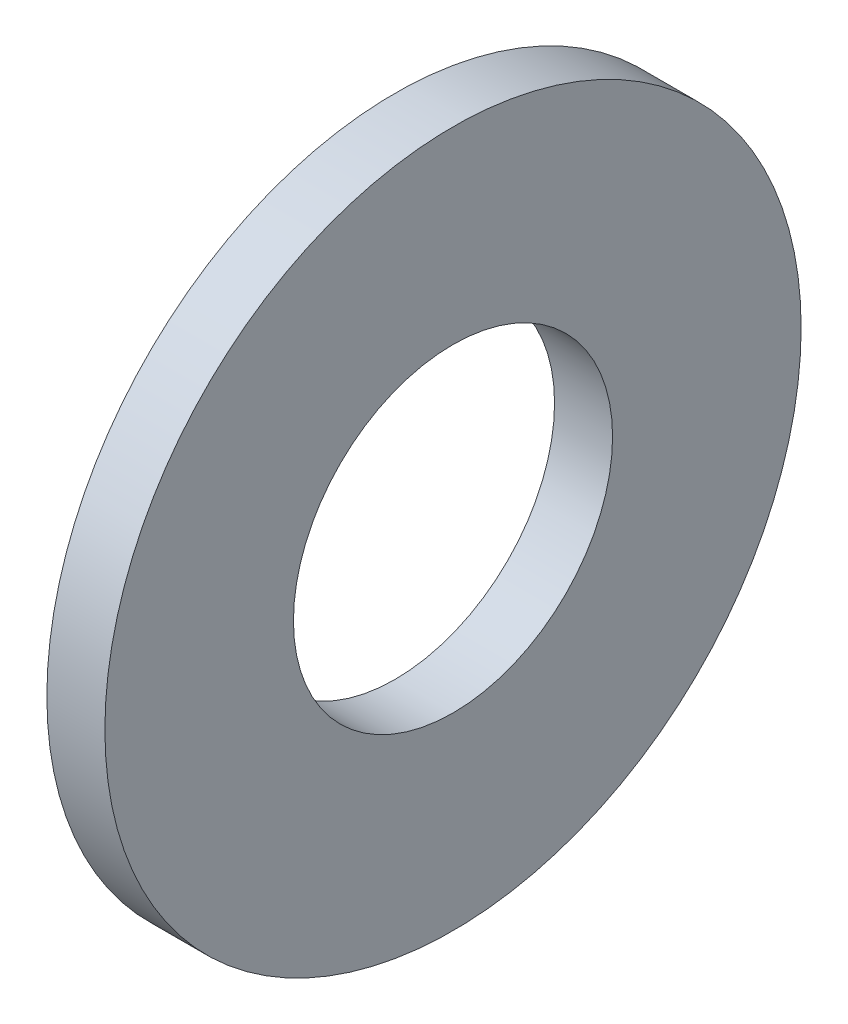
ISO-10303-21;
HEADER;
FILE_DESCRIPTION(('STEP AP214'),'2;1');
FILE_NAME('part.step','',(''),(''),'','','');
FILE_SCHEMA(('AUTOMOTIVE_DESIGN { 1 0 10303 214 1 1 1 1 }'));
ENDSEC;
DATA;
#1=APPLICATION_CONTEXT('core data for automotive mechanical design processes');
#2=APPLICATION_PROTOCOL_DEFINITION('international standard','automotive_design',2000,#1);
#3=PRODUCT_CONTEXT('',#1,'mechanical');
#4=PRODUCT('Part','Part','',(#3));
#5=PRODUCT_RELATED_PRODUCT_CATEGORY('part','',(#4));
#6=PRODUCT_DEFINITION_FORMATION('','',#4);
#7=PRODUCT_DEFINITION_CONTEXT('part definition',#1,'design');
#8=PRODUCT_DEFINITION('design','',#6,#7);
#9=PRODUCT_DEFINITION_SHAPE('','',#8);
#10=(LENGTH_UNIT() NAMED_UNIT(*) SI_UNIT(.MILLI.,.METRE.));
#11=(NAMED_UNIT(*) PLANE_ANGLE_UNIT() SI_UNIT($,.RADIAN.));
#12=(NAMED_UNIT(*) SI_UNIT($,.STERADIAN.) SOLID_ANGLE_UNIT());
#13=UNCERTAINTY_MEASURE_WITH_UNIT(LENGTH_MEASURE(1.E-05),#10,'distance_accuracy_value','');
#14=(GEOMETRIC_REPRESENTATION_CONTEXT(3) GLOBAL_UNCERTAINTY_ASSIGNED_CONTEXT((#13)) GLOBAL_UNIT_ASSIGNED_CONTEXT((#10,
#11,#12)) REPRESENTATION_CONTEXT('',''));
#15=CARTESIAN_POINT('',(0.,0.,0.));
#16=DIRECTION('',(0.,0.,1.));
#17=DIRECTION('',(1.,0.,0.));
#18=AXIS2_PLACEMENT_3D('',#15,#16,#17);
#19=CARTESIAN_POINT('',(0.5,0.,0.));
#20=DIRECTION('',(1.,0.,0.));
#21=DIRECTION('',(0.,0.,-1.));
#22=AXIS2_PLACEMENT_3D('',#19,#20,#21);
#23=CIRCLE('',#22,2.75);
#24=DIRECTION('',(-1.,0.,0.));
#25=VECTOR('',#24,1.);
#26=SURFACE_OF_LINEAR_EXTRUSION('',#23,#25);
#27=CARTESIAN_POINT('',(1.,0.,0.));
#28=DIRECTION('',(-1.,0.,0.));
#29=DIRECTION('',(0.,0.,-1.));
#30=AXIS2_PLACEMENT_3D('',#27,#28,#29);
#31=CIRCLE('',#30,2.75);
#32=CARTESIAN_POINT('',(1.,0.,-2.75));
#33=VERTEX_POINT('',#32);
#34=EDGE_CURVE('E28',#33,#33,#31,.T.);
#35=ORIENTED_EDGE('',*,*,#34,.F.);
#36=EDGE_LOOP('',(#35));
#37=FACE_BOUND('',#36,.T.);
#38=CARTESIAN_POINT('',(0.,0.,0.));
#39=DIRECTION('',(-1.,0.,0.));
#40=DIRECTION('',(0.,0.,-1.));
#41=AXIS2_PLACEMENT_3D('',#38,#39,#40);
#42=CIRCLE('',#41,2.75);
#43=CARTESIAN_POINT('',(0.,0.,-2.75));
#44=VERTEX_POINT('',#43);
#45=EDGE_CURVE('E32',#44,#44,#42,.T.);
#46=ORIENTED_EDGE('',*,*,#45,.T.);
#47=EDGE_LOOP('',(#46));
#48=FACE_BOUND('',#47,.T.);
#49=ADVANCED_FACE('F15',(#37,#48),#26,.T.);
#50=CARTESIAN_POINT('',(0.,0.,-4.375));
#51=DIRECTION('',(-1.,0.,0.));
#52=DIRECTION('',(0.,0.,1.));
#53=AXIS2_PLACEMENT_3D('',#50,#51,#52);
#54=PLANE('',#53);
#55=CARTESIAN_POINT('',(0.,0.,0.));
#56=DIRECTION('',(-1.,0.,0.));
#57=DIRECTION('',(0.,0.,-1.));
#58=AXIS2_PLACEMENT_3D('',#55,#56,#57);
#59=CIRCLE('',#58,6.00000000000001);
#60=CARTESIAN_POINT('',(0.,0.,-6.00000000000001));
#61=VERTEX_POINT('',#60);
#62=EDGE_CURVE('E10',#61,#61,#59,.T.);
#63=ORIENTED_EDGE('',*,*,#62,.T.);
#64=EDGE_LOOP('',(#63));
#65=FACE_BOUND('',#64,.T.);
#66=ORIENTED_EDGE('',*,*,#45,.F.);
#67=EDGE_LOOP('',(#66));
#68=FACE_BOUND('',#67,.T.);
#69=ADVANCED_FACE('F37',(#65,#68),#54,.T.);
#70=CARTESIAN_POINT('',(0.5,0.,0.));
#71=DIRECTION('',(-1.,0.,0.));
#72=DIRECTION('',(0.,0.,1.));
#73=AXIS2_PLACEMENT_3D('',#70,#71,#72);
#74=CYLINDRICAL_SURFACE('',#73,6.00000000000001);
#75=CARTESIAN_POINT('',(1.,0.,0.));
#76=DIRECTION('',(-1.,0.,0.));
#77=DIRECTION('',(0.,0.,-1.));
#78=AXIS2_PLACEMENT_3D('',#75,#76,#77);
#79=CIRCLE('',#78,6.00000000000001);
#80=CARTESIAN_POINT('',(1.,0.,-6.00000000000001));
#81=VERTEX_POINT('',#80);
#82=EDGE_CURVE('E23',#81,#81,#79,.T.);
#83=ORIENTED_EDGE('',*,*,#82,.T.);
#84=EDGE_LOOP('',(#83));
#85=FACE_BOUND('',#84,.T.);
#86=ORIENTED_EDGE('',*,*,#62,.F.);
#87=EDGE_LOOP('',(#86));
#88=FACE_BOUND('',#87,.T.);
#89=ADVANCED_FACE('F39',(#85,#88),#74,.T.);
#90=CARTESIAN_POINT('',(1.,0.,-4.375));
#91=DIRECTION('',(1.,0.,0.));
#92=DIRECTION('',(0.,0.,-1.));
#93=AXIS2_PLACEMENT_3D('',#90,#91,#92);
#94=PLANE('',#93);
#95=ORIENTED_EDGE('',*,*,#34,.T.);
#96=EDGE_LOOP('',(#95));
#97=FACE_BOUND('',#96,.T.);
#98=ORIENTED_EDGE('',*,*,#82,.F.);
#99=EDGE_LOOP('',(#98));
#100=FACE_BOUND('',#99,.T.);
#101=ADVANCED_FACE('F17',(#97,#100),#94,.T.);
#102=CLOSED_SHELL('',(#49,#69,#89,#101));
#103=MANIFOLD_SOLID_BREP('B1',#102);
#104=ADVANCED_BREP_SHAPE_REPRESENTATION('',(#18,#103),#14);
#105=SHAPE_DEFINITION_REPRESENTATION(#9,#104);
ENDSEC;
END-ISO-10303-21;
